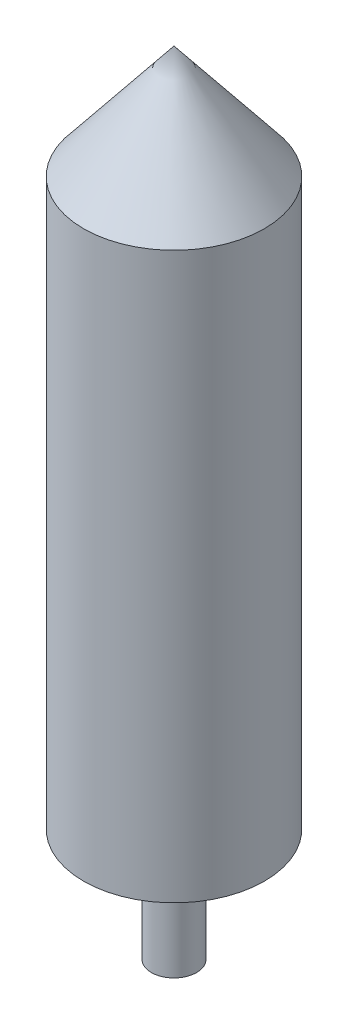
ISO-10303-21;
HEADER;
FILE_DESCRIPTION(('STEP AP214'),'2;1');
FILE_NAME('part.step','',(''),(''),'','','');
FILE_SCHEMA(('AUTOMOTIVE_DESIGN { 1 0 10303 214 1 1 1 1 }'));
ENDSEC;
DATA;
#1=APPLICATION_CONTEXT('core data for automotive mechanical design processes');
#2=APPLICATION_PROTOCOL_DEFINITION('international standard','automotive_design',2000,#1);
#3=PRODUCT_CONTEXT('',#1,'mechanical');
#4=PRODUCT('Part','Part','',(#3));
#5=PRODUCT_RELATED_PRODUCT_CATEGORY('part','',(#4));
#6=PRODUCT_DEFINITION_FORMATION('','',#4);
#7=PRODUCT_DEFINITION_CONTEXT('part definition',#1,'design');
#8=PRODUCT_DEFINITION('design','',#6,#7);
#9=PRODUCT_DEFINITION_SHAPE('','',#8);
#10=(LENGTH_UNIT() NAMED_UNIT(*) SI_UNIT(.MILLI.,.METRE.));
#11=(NAMED_UNIT(*) PLANE_ANGLE_UNIT() SI_UNIT($,.RADIAN.));
#12=(NAMED_UNIT(*) SI_UNIT($,.STERADIAN.) SOLID_ANGLE_UNIT());
#13=UNCERTAINTY_MEASURE_WITH_UNIT(LENGTH_MEASURE(1.E-05),#10,'distance_accuracy_value','');
#14=(GEOMETRIC_REPRESENTATION_CONTEXT(3) GLOBAL_UNCERTAINTY_ASSIGNED_CONTEXT((#13)) GLOBAL_UNIT_ASSIGNED_CONTEXT((#10,
#11,#12)) REPRESENTATION_CONTEXT('',''));
#15=CARTESIAN_POINT('',(0.,0.,0.));
#16=DIRECTION('',(0.,0.,1.));
#17=DIRECTION('',(1.,0.,0.));
#18=AXIS2_PLACEMENT_3D('',#15,#16,#17);
#19=CARTESIAN_POINT('',(0.,70.,0.));
#20=DIRECTION('',(0.,1.,0.));
#21=DIRECTION('',(-1.,0.,0.));
#22=AXIS2_PLACEMENT_3D('',#19,#20,#21);
#23=CYLINDRICAL_SURFACE('',#22,8.);
#24=CARTESIAN_POINT('',(0.,60.,0.));
#25=DIRECTION('',(0.,1.,0.));
#26=DIRECTION('',(-1.,0.,0.));
#27=AXIS2_PLACEMENT_3D('',#24,#25,#26);
#28=CIRCLE('',#27,8.);
#29=CARTESIAN_POINT('',(-8.,60.,0.));
#30=VERTEX_POINT('',#29);
#31=EDGE_CURVE('E52',#30,#30,#28,.T.);
#32=ORIENTED_EDGE('',*,*,#31,.F.);
#33=EDGE_LOOP('',(#32));
#34=FACE_BOUND('',#33,.T.);
#35=CARTESIAN_POINT('',(0.,10.,0.));
#36=DIRECTION('',(0.,1.,0.));
#37=DIRECTION('',(-1.,0.,0.));
#38=AXIS2_PLACEMENT_3D('',#35,#36,#37);
#39=CIRCLE('',#38,8.);
#40=CARTESIAN_POINT('',(-8.,10.,0.));
#41=VERTEX_POINT('',#40);
#42=EDGE_CURVE('E11',#41,#41,#39,.T.);
#43=ORIENTED_EDGE('',*,*,#42,.T.);
#44=EDGE_LOOP('',(#43));
#45=FACE_BOUND('',#44,.T.);
#46=ADVANCED_FACE('F36',(#34,#45),#23,.T.);
#47=CARTESIAN_POINT('',(2.,10.,0.));
#48=DIRECTION('',(0.,1.,0.));
#49=DIRECTION('',(-1.,0.,0.));
#50=AXIS2_PLACEMENT_3D('',#47,#48,#49);
#51=PLANE('',#50);
#52=ORIENTED_EDGE('',*,*,#42,.F.);
#53=EDGE_LOOP('',(#52));
#54=FACE_BOUND('',#53,.T.);
#55=CARTESIAN_POINT('',(0.,10.,0.));
#56=DIRECTION('',(0.,1.,0.));
#57=DIRECTION('',(-1.,0.,0.));
#58=AXIS2_PLACEMENT_3D('',#55,#56,#57);
#59=CIRCLE('',#58,2.);
#60=CARTESIAN_POINT('',(-2.,10.,0.));
#61=VERTEX_POINT('',#60);
#62=EDGE_CURVE('E42',#61,#61,#59,.T.);
#63=ORIENTED_EDGE('',*,*,#62,.T.);
#64=EDGE_LOOP('',(#63));
#65=FACE_BOUND('',#64,.T.);
#66=ADVANCED_FACE('F61',(#54,#65),#51,.F.);
#67=CARTESIAN_POINT('',(0.,70.,0.));
#68=DIRECTION('',(0.,1.,0.));
#69=DIRECTION('',(-1.,0.,0.));
#70=AXIS2_PLACEMENT_3D('',#67,#68,#69);
#71=CYLINDRICAL_SURFACE('',#70,2.);
#72=ORIENTED_EDGE('',*,*,#62,.F.);
#73=EDGE_LOOP('',(#72));
#74=FACE_BOUND('',#73,.T.);
#75=CARTESIAN_POINT('',(0.,0.,0.));
#76=DIRECTION('',(0.,1.,0.));
#77=DIRECTION('',(-1.,0.,0.));
#78=AXIS2_PLACEMENT_3D('',#75,#76,#77);
#79=CIRCLE('',#78,2.);
#80=CARTESIAN_POINT('',(-2.,0.,0.));
#81=VERTEX_POINT('',#80);
#82=EDGE_CURVE('E54',#81,#81,#79,.T.);
#83=ORIENTED_EDGE('',*,*,#82,.T.);
#84=EDGE_LOOP('',(#83));
#85=FACE_BOUND('',#84,.T.);
#86=ADVANCED_FACE('F63',(#74,#85),#71,.T.);
#87=CARTESIAN_POINT('',(0.,0.,0.));
#88=DIRECTION('',(0.,1.,0.));
#89=DIRECTION('',(-1.,0.,0.));
#90=AXIS2_PLACEMENT_3D('',#87,#88,#89);
#91=PLANE('',#90);
#92=ORIENTED_EDGE('',*,*,#82,.F.);
#93=EDGE_LOOP('',(#92));
#94=FACE_BOUND('',#93,.T.);
#95=ADVANCED_FACE('F48',(#94),#91,.F.);
#96=CARTESIAN_POINT('',(0.,60.,0.));
#97=DIRECTION('',(0.,-1.,0.));
#98=DIRECTION('',(1.,0.,0.));
#99=AXIS2_PLACEMENT_3D('',#96,#97,#98);
#100=CONICAL_SURFACE('',#99,8.,0.674740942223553);
#101=CARTESIAN_POINT('',(0.,70.,0.));
#102=VERTEX_POINT('',#101);
#103=VERTEX_LOOP('',#102);
#104=FACE_BOUND('',#103,.T.);
#105=ORIENTED_EDGE('',*,*,#31,.T.);
#106=EDGE_LOOP('',(#105));
#107=FACE_BOUND('',#106,.T.);
#108=ADVANCED_FACE('F45',(#104,#107),#100,.T.);
#109=CLOSED_SHELL('',(#46,#66,#86,#95,#108));
#110=MANIFOLD_SOLID_BREP('B2',#109);
#111=ADVANCED_BREP_SHAPE_REPRESENTATION('',(#18,#110),#14);
#112=SHAPE_DEFINITION_REPRESENTATION(#9,#111);
ENDSEC;
END-ISO-10303-21;
